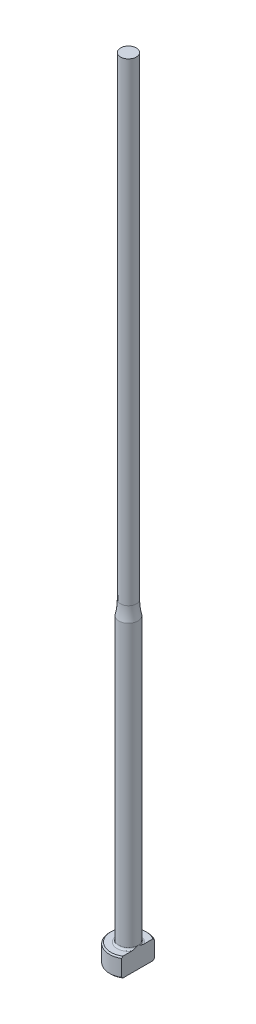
ISO-10303-21;
HEADER;
FILE_DESCRIPTION(('STEP AP214'),'2;1');
FILE_NAME('part.step','',(''),(''),'','','');
FILE_SCHEMA(('AUTOMOTIVE_DESIGN { 1 0 10303 214 1 1 1 1 }'));
ENDSEC;
DATA;
#1=APPLICATION_CONTEXT('core data for automotive mechanical design processes');
#2=APPLICATION_PROTOCOL_DEFINITION('international standard','automotive_design',2000,#1);
#3=PRODUCT_CONTEXT('',#1,'mechanical');
#4=PRODUCT('Part','Part','',(#3));
#5=PRODUCT_RELATED_PRODUCT_CATEGORY('part','',(#4));
#6=PRODUCT_DEFINITION_FORMATION('','',#4);
#7=PRODUCT_DEFINITION_CONTEXT('part definition',#1,'design');
#8=PRODUCT_DEFINITION('design','',#6,#7);
#9=PRODUCT_DEFINITION_SHAPE('','',#8);
#10=(LENGTH_UNIT() NAMED_UNIT(*) SI_UNIT(.MILLI.,.METRE.));
#11=(NAMED_UNIT(*) PLANE_ANGLE_UNIT() SI_UNIT($,.RADIAN.));
#12=(NAMED_UNIT(*) SI_UNIT($,.STERADIAN.) SOLID_ANGLE_UNIT());
#13=UNCERTAINTY_MEASURE_WITH_UNIT(LENGTH_MEASURE(1.E-05),#10,'distance_accuracy_value','');
#14=(GEOMETRIC_REPRESENTATION_CONTEXT(3) GLOBAL_UNCERTAINTY_ASSIGNED_CONTEXT((#13)) GLOBAL_UNIT_ASSIGNED_CONTEXT((#10,
#11,#12)) REPRESENTATION_CONTEXT('',''));
#15=CARTESIAN_POINT('',(0.,0.,0.));
#16=DIRECTION('',(0.,0.,1.));
#17=DIRECTION('',(1.,0.,0.));
#18=AXIS2_PLACEMENT_3D('',#15,#16,#17);
#19=CARTESIAN_POINT('',(-2.99999999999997,3.,0.));
#20=DIRECTION('',(0.,1.,0.));
#21=DIRECTION('',(0.,0.,1.));
#22=AXIS2_PLACEMENT_3D('',#19,#20,#21);
#23=PLANE('',#22);
#24=CARTESIAN_POINT('',(0.,3.,0.));
#25=DIRECTION('',(0.,1.,0.));
#26=DIRECTION('',(0.,0.,1.));
#27=AXIS2_PLACEMENT_3D('',#24,#25,#26);
#28=CIRCLE('',#27,2.79999999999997);
#29=CARTESIAN_POINT('',(1.49999999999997,3.,-2.36431808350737));
#30=VERTEX_POINT('',#29);
#31=CARTESIAN_POINT('',(1.49999999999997,3.,2.36431808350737));
#32=VERTEX_POINT('',#31);
#33=EDGE_CURVE('E187',#30,#32,#28,.T.);
#34=ORIENTED_EDGE('',*,*,#33,.T.);
#35=DIRECTION('',(0.,0.,-1.));
#36=VECTOR('',#35,1.);
#37=CARTESIAN_POINT('',(1.49999999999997,3.,0.));
#38=LINE('',#37,#36);
#39=CARTESIAN_POINT('',(1.49999999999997,3.00000000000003,0.99498743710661));
#40=VERTEX_POINT('',#39);
#41=EDGE_CURVE('E57',#32,#40,#38,.T.);
#42=ORIENTED_EDGE('',*,*,#41,.T.);
#43=CARTESIAN_POINT('',(0.,3.,0.));
#44=DIRECTION('',(0.,1.,0.));
#45=DIRECTION('',(0.,0.,1.));
#46=AXIS2_PLACEMENT_3D('',#43,#44,#45);
#47=CIRCLE('',#46,1.79999999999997);
#48=CARTESIAN_POINT('',(1.49999999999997,3.00000000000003,-0.994987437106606));
#49=VERTEX_POINT('',#48);
#50=EDGE_CURVE('E108',#40,#49,#47,.F.);
#51=ORIENTED_EDGE('',*,*,#50,.T.);
#52=EDGE_CURVE('E137',#49,#30,#38,.T.);
#53=ORIENTED_EDGE('',*,*,#52,.T.);
#54=EDGE_LOOP('',(#34,#42,#51,#53));
#55=FACE_BOUND('',#54,.T.);
#56=ADVANCED_FACE('F32',(#55),#23,.T.);
#57=CARTESIAN_POINT('',(0.,259.958771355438,0.));
#58=DIRECTION('',(0.,1.,0.));
#59=DIRECTION('',(0.,0.,1.));
#60=AXIS2_PLACEMENT_3D('',#57,#58,#59);
#61=CYLINDRICAL_SURFACE('',#60,2.99999999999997);
#62=CARTESIAN_POINT('',(0.,2.80000000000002,0.));
#63=DIRECTION('',(0.,1.,0.));
#64=DIRECTION('',(0.,0.,1.));
#65=AXIS2_PLACEMENT_3D('',#62,#63,#64);
#66=CIRCLE('',#65,2.99999999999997);
#67=CARTESIAN_POINT('',(1.49999999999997,2.80000000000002,2.5980762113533));
#68=VERTEX_POINT('',#67);
#69=CARTESIAN_POINT('',(1.49999999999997,2.80000000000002,-2.5980762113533));
#70=VERTEX_POINT('',#69);
#71=EDGE_CURVE('E105',#68,#70,#66,.F.);
#72=ORIENTED_EDGE('',*,*,#71,.T.);
#73=DIRECTION('',(0.,-1.,0.));
#74=VECTOR('',#73,1.);
#75=CARTESIAN_POINT('',(1.49999999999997,125.,-2.5980762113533));
#76=LINE('',#75,#74);
#77=CARTESIAN_POINT('',(1.49999999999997,0.200000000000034,-2.5980762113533));
#78=VERTEX_POINT('',#77);
#79=EDGE_CURVE('E193',#70,#78,#76,.T.);
#80=ORIENTED_EDGE('',*,*,#79,.T.);
#81=CARTESIAN_POINT('',(0.,0.200000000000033,0.));
#82=DIRECTION('',(0.,-1.,0.));
#83=DIRECTION('',(0.,0.,-1.));
#84=AXIS2_PLACEMENT_3D('',#81,#82,#83);
#85=CIRCLE('',#84,2.99999999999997);
#86=CARTESIAN_POINT('',(1.49999999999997,0.200000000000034,2.5980762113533));
#87=VERTEX_POINT('',#86);
#88=EDGE_CURVE('E100',#78,#87,#85,.F.);
#89=ORIENTED_EDGE('',*,*,#88,.T.);
#90=DIRECTION('',(0.,-1.,0.));
#91=VECTOR('',#90,1.);
#92=CARTESIAN_POINT('',(1.49999999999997,125.,2.5980762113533));
#93=LINE('',#92,#91);
#94=EDGE_CURVE('E93',#68,#87,#93,.T.);
#95=ORIENTED_EDGE('',*,*,#94,.F.);
#96=EDGE_LOOP('',(#72,#80,#89,#95));
#97=FACE_BOUND('',#96,.T.);
#98=ADVANCED_FACE('F158',(#97),#61,.T.);
#99=CARTESIAN_POINT('',(0.,0.,0.));
#100=DIRECTION('',(0.,-1.,0.));
#101=DIRECTION('',(0.,0.,-1.));
#102=AXIS2_PLACEMENT_3D('',#99,#100,#101);
#103=PLANE('',#102);
#104=CARTESIAN_POINT('',(0.,0.,0.));
#105=DIRECTION('',(0.,-1.,0.));
#106=DIRECTION('',(0.,0.,-1.));
#107=AXIS2_PLACEMENT_3D('',#104,#105,#106);
#108=CIRCLE('',#107,2.79999999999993);
#109=CARTESIAN_POINT('',(1.49999999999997,0.,2.36431808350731));
#110=VERTEX_POINT('',#109);
#111=CARTESIAN_POINT('',(1.49999999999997,0.,-2.36431808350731));
#112=VERTEX_POINT('',#111);
#113=EDGE_CURVE('E98',#110,#112,#108,.T.);
#114=ORIENTED_EDGE('',*,*,#113,.T.);
#115=DIRECTION('',(0.,0.,1.));
#116=VECTOR('',#115,1.);
#117=CARTESIAN_POINT('',(1.49999999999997,0.,-2.5980762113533));
#118=LINE('',#117,#116);
#119=EDGE_CURVE('E83',#112,#110,#118,.T.);
#120=ORIENTED_EDGE('',*,*,#119,.T.);
#121=EDGE_LOOP('',(#114,#120));
#122=FACE_BOUND('',#121,.T.);
#123=ADVANCED_FACE('F103',(#122),#103,.T.);
#124=CARTESIAN_POINT('',(0.,3.,0.));
#125=DIRECTION('',(0.,-1.,0.));
#126=DIRECTION('',(0.,0.,-1.));
#127=AXIS2_PLACEMENT_3D('',#124,#125,#126);
#128=CONICAL_SURFACE('',#127,2.79999999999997,0.7853981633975);
#129=ORIENTED_EDGE('',*,*,#71,.F.);
#130=CARTESIAN_POINT('',(1.49999999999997,-0.11174109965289,5.71827621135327));
#131=CARTESIAN_POINT('',(1.49999999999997,0.0136183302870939,5.58866816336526));
#132=CARTESIAN_POINT('',(1.49999999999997,0.138843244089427,5.45892957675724));
#133=CARTESIAN_POINT('',(1.49999999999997,0.388944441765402,5.19911365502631));
#134=CARTESIAN_POINT('',(1.49999999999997,0.513820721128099,5.06903631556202));
#135=CARTESIAN_POINT('',(1.49999999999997,0.763205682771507,4.8084018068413));
#136=CARTESIAN_POINT('',(1.49999999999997,0.887714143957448,4.67784442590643));
#137=CARTESIAN_POINT('',(1.49999999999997,1.13618059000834,4.41620813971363));
#138=CARTESIAN_POINT('',(1.49999999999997,1.2601385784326,4.28512923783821));
#139=CARTESIAN_POINT('',(1.49999999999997,1.50488975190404,4.02490837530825));
#140=CARTESIAN_POINT('',(1.49999999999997,1.6256969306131,3.89577958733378));
#141=CARTESIAN_POINT('',(1.49999999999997,1.86640694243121,3.63668213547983));
#142=CARTESIAN_POINT('',(1.49999999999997,1.98630978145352,3.5067134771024));
#143=CARTESIAN_POINT('',(1.49999999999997,2.22486033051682,3.24567921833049));
#144=CARTESIAN_POINT('',(1.49999999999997,2.34350830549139,3.11461386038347));
#145=CARTESIAN_POINT('',(1.49999999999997,2.57907716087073,2.85094268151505));
#146=CARTESIAN_POINT('',(1.49999999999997,2.69599811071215,2.71833692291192));
#147=CARTESIAN_POINT('',(1.49999999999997,2.88262371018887,2.50255231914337));
#148=CARTESIAN_POINT('',(1.49999999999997,2.95312454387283,2.42006293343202));
#149=CARTESIAN_POINT('',(1.49999999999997,3.09287098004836,2.25401084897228));
#150=CARTESIAN_POINT('',(1.49999999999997,3.16211645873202,2.170448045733));
#151=CARTESIAN_POINT('',(1.49999999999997,3.2996468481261,2.00105967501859));
#152=CARTESIAN_POINT('',(1.49999999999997,3.36791386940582,1.91521952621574));
#153=CARTESIAN_POINT('',(1.49999999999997,3.50205840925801,1.74171392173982));
#154=CARTESIAN_POINT('',(1.49999999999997,3.56793649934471,1.65404891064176));
#155=CARTESIAN_POINT('',(1.49999999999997,3.69728151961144,1.47490236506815));
#156=CARTESIAN_POINT('',(1.49999999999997,3.76069661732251,1.38338308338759));
#157=CARTESIAN_POINT('',(1.49999999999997,3.88239539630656,1.1967566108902));
#158=CARTESIAN_POINT('',(1.49999999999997,3.94067201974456,1.10164473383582));
#159=CARTESIAN_POINT('',(1.49999999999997,4.0484132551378,0.908008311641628));
#160=CARTESIAN_POINT('',(1.49999999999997,4.09797809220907,0.809540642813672));
#161=CARTESIAN_POINT('',(1.49999999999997,4.18432188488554,0.607192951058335));
#162=CARTESIAN_POINT('',(1.49999999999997,4.22114374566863,0.503332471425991));
#163=CARTESIAN_POINT('',(1.49999999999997,4.26099935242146,0.347577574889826));
#164=CARTESIAN_POINT('',(1.49999999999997,4.27157029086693,0.29760995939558));
#165=CARTESIAN_POINT('',(1.49999999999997,4.28794860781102,0.196885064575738));
#166=CARTESIAN_POINT('',(1.49999999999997,4.29375640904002,0.146127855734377));
#167=CARTESIAN_POINT('',(1.49999999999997,4.30019707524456,0.0444388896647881));
#168=CARTESIAN_POINT('',(1.49999999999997,4.30084594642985,-0.00649183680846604));
#169=CARTESIAN_POINT('',(1.49999999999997,4.29696416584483,-0.108155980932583));
#170=CARTESIAN_POINT('',(1.49999999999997,4.29243308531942,-0.158889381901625));
#171=CARTESIAN_POINT('',(1.49999999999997,4.27856915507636,-0.259234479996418));
#172=CARTESIAN_POINT('',(1.49999999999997,4.26927821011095,-0.308852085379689));
#173=CARTESIAN_POINT('',(1.49999999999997,4.24647108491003,-0.407110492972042));
#174=CARTESIAN_POINT('',(1.49999999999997,4.2329532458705,-0.455750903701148));
#175=CARTESIAN_POINT('',(1.49999999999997,4.20226175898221,-0.552149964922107));
#176=CARTESIAN_POINT('',(1.49999999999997,4.18506801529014,-0.599902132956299));
#177=CARTESIAN_POINT('',(1.49999999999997,4.14771387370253,-0.694205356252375));
#178=CARTESIAN_POINT('',(1.49999999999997,4.12755408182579,-0.740756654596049));
#179=CARTESIAN_POINT('',(1.49999999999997,4.06327696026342,-0.879166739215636));
#180=CARTESIAN_POINT('',(1.49999999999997,4.01551721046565,-0.969329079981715));
#181=CARTESIAN_POINT('',(1.49999999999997,3.91367909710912,-1.1460431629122));
#182=CARTESIAN_POINT('',(1.49999999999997,3.85959300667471,-1.23259031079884));
#183=CARTESIAN_POINT('',(1.49999999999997,3.74697968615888,-1.40321348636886));
#184=CARTESIAN_POINT('',(1.49999999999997,3.68843573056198,-1.48727838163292));
#185=CARTESIAN_POINT('',(1.49999999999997,3.56843845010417,-1.65322187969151));
#186=CARTESIAN_POINT('',(1.49999999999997,3.50698656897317,-1.73510153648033));
#187=CARTESIAN_POINT('',(1.49999999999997,3.38115673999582,-1.89829823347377));
#188=CARTESIAN_POINT('',(1.49999999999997,3.31675092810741,-1.9795936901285));
#189=CARTESIAN_POINT('',(1.49999999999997,3.18634068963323,-2.14090082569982));
#190=CARTESIAN_POINT('',(1.49999999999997,3.12033609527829,-2.22091236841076));
#191=CARTESIAN_POINT('',(1.49999999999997,2.9208643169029,-2.4590650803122));
#192=CARTESIAN_POINT('',(1.49999999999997,2.78562663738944,-2.6157209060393));
#193=CARTESIAN_POINT('',(1.49999999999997,2.53554498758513,-2.90006295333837));
#194=CARTESIAN_POINT('',(1.49999999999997,2.421145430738,-3.02814382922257));
#195=CARTESIAN_POINT('',(1.49999999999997,2.19093557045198,-3.28303767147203));
#196=CARTESIAN_POINT('',(1.49999999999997,2.07512522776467,-3.40985060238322));
#197=CARTESIAN_POINT('',(1.49999999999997,1.72597067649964,-3.78913849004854));
#198=CARTESIAN_POINT('',(1.49999999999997,1.49111760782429,-4.04022177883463));
#199=CARTESIAN_POINT('',(1.49999999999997,1.02882478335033,-4.52992803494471));
#200=CARTESIAN_POINT('',(1.49999999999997,0.801477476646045,-4.76863870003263));
#201=CARTESIAN_POINT('',(1.49999999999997,0.459548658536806,-5.12558036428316));
#202=CARTESIAN_POINT('',(1.49999999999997,0.345484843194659,-5.24430773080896));
#203=CARTESIAN_POINT('',(1.49999999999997,0.117071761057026,-5.48148573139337));
#204=CARTESIAN_POINT('',(1.49999999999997,0.00272249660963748,-5.59993636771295));
#205=CARTESIAN_POINT('',(1.49999999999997,-0.111741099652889,-5.71827621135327));
#206=B_SPLINE_CURVE_WITH_KNOTS('',3,(#130,#131,#132,#133,#134,#135,#136,#137,#138,#139,#140,
#141,#142,#143,#144,#145,#146,#147,#148,#149,#150,#151,#152,#153,#154,#155,#156,#157,#158,#159,
#160,#161,#162,#163,#164,#165,#166,#167,#168,#169,#170,#171,#172,#173,#174,#175,#176,#177,#178,
#179,#180,#181,#182,#183,#184,#185,#186,#187,#188,#189,#190,#191,#192,#193,#194,#195,#196,#197,
#198,#199,#200,#201,#202,#203,#204,#205),.UNSPECIFIED.,.F.,.F.,(4,2,2,2,2,2,2,2,2,2,2,2,2,2,2,2,
2,2,2,2,2,2,2,2,2,2,2,2,2,2,2,2,2,2,2,2,2,4),(0.,0.540943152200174,1.08189327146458,
1.62312052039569,2.16434426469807,2.69482920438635,3.22531067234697,3.75567781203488,
4.28602356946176,4.61155053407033,4.93710943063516,5.26610945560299,5.59503024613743,
5.92894782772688,6.26331713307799,6.59354403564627,6.92264800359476,7.07567478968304,
7.22868799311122,7.38122626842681,7.53377717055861,7.68500755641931,7.83629736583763,
7.98843643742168,8.14054446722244,8.4461879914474,8.75220879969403,9.05944044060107,
9.366521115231,9.677642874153,9.98879742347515,10.6095925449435,11.1247803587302,
11.6399825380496,12.6713544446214,13.6603005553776,14.1542238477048,14.648143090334),.UNSPECIFIED.);
#207=EDGE_CURVE('E136',#68,#32,#206,.T.);
#208=ORIENTED_EDGE('',*,*,#207,.T.);
#209=ORIENTED_EDGE('',*,*,#33,.F.);
#210=EDGE_CURVE('E128',#30,#70,#206,.T.);
#211=ORIENTED_EDGE('',*,*,#210,.T.);
#212=EDGE_LOOP('',(#129,#208,#209,#211));
#213=FACE_BOUND('',#212,.T.);
#214=ADVANCED_FACE('F144',(#213),#128,.T.);
#215=CARTESIAN_POINT('',(0.,0.200000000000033,0.));
#216=DIRECTION('',(0.,1.,0.));
#217=DIRECTION('',(0.,0.,1.));
#218=AXIS2_PLACEMENT_3D('',#215,#216,#217);
#219=CONICAL_SURFACE('',#218,2.99999999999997,0.785398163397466);
#220=ORIENTED_EDGE('',*,*,#88,.F.);
#221=CARTESIAN_POINT('',(1.49999999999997,3.11174109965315,-5.71827621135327));
#222=CARTESIAN_POINT('',(1.49999999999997,2.98638166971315,-5.58866816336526));
#223=CARTESIAN_POINT('',(1.49999999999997,2.8611567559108,-5.45892957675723));
#224=CARTESIAN_POINT('',(1.49999999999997,2.6110555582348,-5.19911365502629));
#225=CARTESIAN_POINT('',(1.49999999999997,2.48617927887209,-5.06903631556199));
#226=CARTESIAN_POINT('',(1.49999999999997,2.23679431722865,-4.80840180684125));
#227=CARTESIAN_POINT('',(1.49999999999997,2.11228585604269,-4.67784442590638));
#228=CARTESIAN_POINT('',(1.49999999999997,1.86381940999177,-4.41620813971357));
#229=CARTESIAN_POINT('',(1.49999999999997,1.7398614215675,-4.28512923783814));
#230=CARTESIAN_POINT('',(1.49999999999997,1.49511024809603,-4.02490837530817));
#231=CARTESIAN_POINT('',(1.49999999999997,1.37430306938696,-3.89577958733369));
#232=CARTESIAN_POINT('',(1.49999999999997,1.13359305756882,-3.63668213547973));
#233=CARTESIAN_POINT('',(1.49999999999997,1.0136902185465,-3.50671347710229));
#234=CARTESIAN_POINT('',(1.49999999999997,0.775139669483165,-3.24567921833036));
#235=CARTESIAN_POINT('',(1.49999999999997,0.656491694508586,-3.11461386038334));
#236=CARTESIAN_POINT('',(1.49999999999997,0.420922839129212,-2.85094268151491));
#237=CARTESIAN_POINT('',(1.49999999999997,0.304001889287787,-2.71833692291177));
#238=CARTESIAN_POINT('',(1.49999999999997,0.117376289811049,-2.50255231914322));
#239=CARTESIAN_POINT('',(1.49999999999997,0.0468754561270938,-2.42006293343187));
#240=CARTESIAN_POINT('',(1.49999999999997,-0.0928709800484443,-2.25401084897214));
#241=CARTESIAN_POINT('',(1.49999999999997,-0.162116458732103,-2.17044804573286));
#242=CARTESIAN_POINT('',(1.49999999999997,-0.299646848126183,-2.00105967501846));
#243=CARTESIAN_POINT('',(1.49999999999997,-0.367913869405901,-1.91521952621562));
#244=CARTESIAN_POINT('',(1.49999999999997,-0.502058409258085,-1.74171392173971));
#245=CARTESIAN_POINT('',(1.49999999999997,-0.567936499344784,-1.65404891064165));
#246=CARTESIAN_POINT('',(1.49999999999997,-0.697281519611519,-1.47490236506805));
#247=CARTESIAN_POINT('',(1.49999999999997,-0.760696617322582,-1.38338308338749));
#248=CARTESIAN_POINT('',(1.49999999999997,-0.882395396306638,-1.19675661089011));
#249=CARTESIAN_POINT('',(1.49999999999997,-0.940672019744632,-1.10164473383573));
#250=CARTESIAN_POINT('',(1.49999999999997,-1.04841325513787,-0.908008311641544));
#251=CARTESIAN_POINT('',(1.49999999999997,-1.09797809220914,-0.809540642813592));
#252=CARTESIAN_POINT('',(1.49999999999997,-1.1843218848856,-0.60719295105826));
#253=CARTESIAN_POINT('',(1.49999999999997,-1.22114374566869,-0.503332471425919));
#254=CARTESIAN_POINT('',(1.49999999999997,-1.26099935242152,-0.347577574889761));
#255=CARTESIAN_POINT('',(1.49999999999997,-1.27157029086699,-0.29760995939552));
#256=CARTESIAN_POINT('',(1.49999999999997,-1.28794860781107,-0.196885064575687));
#257=CARTESIAN_POINT('',(1.49999999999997,-1.29375640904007,-0.146127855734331));
#258=CARTESIAN_POINT('',(1.49999999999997,-1.30019707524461,-0.0444388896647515));
#259=CARTESIAN_POINT('',(1.49999999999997,-1.3008459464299,0.00649183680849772));
#260=CARTESIAN_POINT('',(1.49999999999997,-1.29696416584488,0.108155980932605));
#261=CARTESIAN_POINT('',(1.49999999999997,-1.29243308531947,0.158889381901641));
#262=CARTESIAN_POINT('',(1.49999999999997,-1.2785691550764,0.259234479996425));
#263=CARTESIAN_POINT('',(1.49999999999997,-1.26927821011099,0.308852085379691));
#264=CARTESIAN_POINT('',(1.49999999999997,-1.24647108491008,0.407110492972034));
#265=CARTESIAN_POINT('',(1.49999999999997,-1.23295324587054,0.455750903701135));
#266=CARTESIAN_POINT('',(1.49999999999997,-1.20226175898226,0.552149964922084));
#267=CARTESIAN_POINT('',(1.49999999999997,-1.18506801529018,0.599902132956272));
#268=CARTESIAN_POINT('',(1.49999999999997,-1.14771387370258,0.694205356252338));
#269=CARTESIAN_POINT('',(1.49999999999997,-1.12755408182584,0.740756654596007));
#270=CARTESIAN_POINT('',(1.49999999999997,-1.06327696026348,0.879166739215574));
#271=CARTESIAN_POINT('',(1.49999999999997,-1.01551721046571,0.969329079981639));
#272=CARTESIAN_POINT('',(1.49999999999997,-0.913679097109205,1.1460431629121));
#273=CARTESIAN_POINT('',(1.49999999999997,-0.8595930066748,1.23259031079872));
#274=CARTESIAN_POINT('',(1.49999999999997,-0.746979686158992,1.40321348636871));
#275=CARTESIAN_POINT('',(1.49999999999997,-0.688435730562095,1.48727838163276));
#276=CARTESIAN_POINT('',(1.49999999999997,-0.568438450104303,1.65322187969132));
#277=CARTESIAN_POINT('',(1.49999999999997,-0.506986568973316,1.73510153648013));
#278=CARTESIAN_POINT('',(1.49999999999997,-0.381156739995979,1.89829823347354));
#279=CARTESIAN_POINT('',(1.49999999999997,-0.316750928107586,1.97959369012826));
#280=CARTESIAN_POINT('',(1.49999999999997,-0.186340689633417,2.14090082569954));
#281=CARTESIAN_POINT('',(1.49999999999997,-0.120336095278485,2.22091236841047));
#282=CARTESIAN_POINT('',(1.49999999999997,0.0791356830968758,2.45906508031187));
#283=CARTESIAN_POINT('',(1.49999999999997,0.214373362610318,2.61572090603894));
#284=CARTESIAN_POINT('',(1.49999999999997,0.46445501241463,2.90006295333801));
#285=CARTESIAN_POINT('',(1.49999999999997,0.578854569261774,3.02814382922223));
#286=CARTESIAN_POINT('',(1.49999999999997,0.809064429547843,3.28303767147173));
#287=CARTESIAN_POINT('',(1.49999999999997,0.924874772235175,3.40985060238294));
#288=CARTESIAN_POINT('',(1.49999999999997,1.27402932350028,3.78913849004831));
#289=CARTESIAN_POINT('',(1.49999999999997,1.50888239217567,4.04022177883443));
#290=CARTESIAN_POINT('',(1.49999999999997,1.97117521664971,4.52992803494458));
#291=CARTESIAN_POINT('',(1.49999999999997,2.19852252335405,4.76863870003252));
#292=CARTESIAN_POINT('',(1.49999999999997,2.54045134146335,5.12558036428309));
#293=CARTESIAN_POINT('',(1.49999999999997,2.65451515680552,5.2443077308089));
#294=CARTESIAN_POINT('',(1.49999999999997,2.88292823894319,5.48148573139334));
#295=CARTESIAN_POINT('',(1.49999999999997,2.9972775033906,5.59993636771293));
#296=CARTESIAN_POINT('',(1.49999999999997,3.11174109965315,5.71827621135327));
#297=B_SPLINE_CURVE_WITH_KNOTS('',3,(#221,#222,#223,#224,#225,#226,#227,#228,#229,#230,#231,
#232,#233,#234,#235,#236,#237,#238,#239,#240,#241,#242,#243,#244,#245,#246,#247,#248,#249,#250,
#251,#252,#253,#254,#255,#256,#257,#258,#259,#260,#261,#262,#263,#264,#265,#266,#267,#268,#269,
#270,#271,#272,#273,#274,#275,#276,#277,#278,#279,#280,#281,#282,#283,#284,#285,#286,#287,#288,
#289,#290,#291,#292,#293,#294,#295,#296),.UNSPECIFIED.,.F.,.F.,(4,2,2,2,2,2,2,2,2,2,2,2,2,2,2,2,
2,2,2,2,2,2,2,2,2,2,2,2,2,2,2,2,2,2,2,2,2,4),(0.,0.540943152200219,1.08189327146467,
1.62312052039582,2.16434426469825,2.69482920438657,3.22531067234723,3.75567781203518,
4.28602356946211,4.61155053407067,4.93710943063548,5.2661094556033,5.59503024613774,
5.92894782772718,6.26331713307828,6.59354403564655,6.92264800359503,7.0756747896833,
7.22868799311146,7.38122626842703,7.53377717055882,7.68500755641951,7.83629736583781,
7.98843643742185,8.14054446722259,8.4461879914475,8.75220879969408,9.05944044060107,
9.36652111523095,9.6776428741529,9.98879742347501,10.6095925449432,11.1247803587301,
11.6399825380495,12.6713544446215,13.6603005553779,14.1542238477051,14.6481430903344),.UNSPECIFIED.);
#298=EDGE_CURVE('E86',#78,#112,#297,.T.);
#299=ORIENTED_EDGE('',*,*,#298,.T.);
#300=ORIENTED_EDGE('',*,*,#113,.F.);
#301=EDGE_CURVE('E89',#110,#87,#297,.T.);
#302=ORIENTED_EDGE('',*,*,#301,.T.);
#303=EDGE_LOOP('',(#220,#299,#300,#302));
#304=FACE_BOUND('',#303,.T.);
#305=ADVANCED_FACE('F97',(#304),#219,.T.);
#306=CARTESIAN_POINT('',(0.,3.30000000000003,0.));
#307=DIRECTION('',(0.,1.,0.));
#308=DIRECTION('',(0.,0.,1.));
#309=AXIS2_PLACEMENT_3D('',#306,#307,#308);
#310=TOROIDAL_SURFACE('',#309,1.79999999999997,0.3);
#311=CARTESIAN_POINT('',(1.49999999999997,3.30000000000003,0.));
#312=CARTESIAN_POINT('',(1.49999999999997,3.300000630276,3.41555678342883E-12));
#313=CARTESIAN_POINT('',(1.49999999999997,3.30000126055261,-1.15373640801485E-07));
#314=CARTESIAN_POINT('',(1.49999999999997,3.3000024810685,-4.90631575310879E-07));
#315=CARTESIAN_POINT('',(1.49999999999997,3.30000307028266,-7.53296670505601E-07));
#316=CARTESIAN_POINT('',(1.49999999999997,3.30000424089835,-1.38757096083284E-06));
#317=CARTESIAN_POINT('',(1.49999999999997,3.300004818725,-1.76563001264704E-06));
#318=CARTESIAN_POINT('',(1.49999999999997,3.30000591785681,-2.58768006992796E-06));
#319=CARTESIAN_POINT('',(1.49999999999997,3.30000643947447,-3.03127014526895E-06));
#320=CARTESIAN_POINT('',(1.49999999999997,3.30000815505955,-4.60021967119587E-06));
#321=CARTESIAN_POINT('',(1.49999999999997,3.30000927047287,-5.8124152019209E-06));
#322=CARTESIAN_POINT('',(1.49999999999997,3.30001128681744,-8.33989413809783E-06));
#323=CARTESIAN_POINT('',(1.49999999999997,3.30001219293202,-9.65128157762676E-06));
#324=CARTESIAN_POINT('',(1.49999999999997,3.30001551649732,-1.46782505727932E-05));
#325=CARTESIAN_POINT('',(1.49999999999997,3.30001775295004,-1.8517976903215E-05));
#326=CARTESIAN_POINT('',(1.49999999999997,3.30002148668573,-2.61616194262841E-05));
#327=CARTESIAN_POINT('',(1.49999999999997,3.30002302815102,-2.99447742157E-05));
#328=CARTESIAN_POINT('',(1.49999999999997,3.30002943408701,-4.58003743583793E-05));
#329=CARTESIAN_POINT('',(1.49999999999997,3.3000341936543,-5.79079078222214E-05));
#330=CARTESIAN_POINT('',(1.49999999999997,3.30004197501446,-8.07263755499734E-05));
#331=CARTESIAN_POINT('',(1.49999999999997,3.30004514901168,-9.13834709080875E-05));
#332=CARTESIAN_POINT('',(1.49999999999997,3.30006989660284,-0.000167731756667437));
#333=CARTESIAN_POINT('',(1.49999999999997,3.30010092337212,-0.000229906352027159));
#334=CARTESIAN_POINT('',(1.49999999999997,3.30021632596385,-0.000470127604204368));
#335=CARTESIAN_POINT('',(1.49999999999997,3.30029368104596,-0.000650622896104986));
#336=CARTESIAN_POINT('',(1.49999999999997,3.30059619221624,-0.00134589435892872));
#337=CARTESIAN_POINT('',(1.49999999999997,3.30082870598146,-0.00185814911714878));
#338=CARTESIAN_POINT('',(1.49999999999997,3.30176696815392,-0.00393547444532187));
#339=CARTESIAN_POINT('',(1.49999999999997,3.30246445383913,-0.00550332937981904));
#340=CARTESIAN_POINT('',(1.49999999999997,3.31426785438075,-0.0320229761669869));
#341=CARTESIAN_POINT('',(1.49999999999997,3.32544800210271,-0.0569503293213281));
#342=CARTESIAN_POINT('',(1.49999999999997,3.34725700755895,-0.105984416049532));
#343=CARTESIAN_POINT('',(1.49999999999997,3.35789134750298,-0.130088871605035));
#344=CARTESIAN_POINT('',(1.49999999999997,3.38015321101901,-0.181096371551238));
#345=CARTESIAN_POINT('',(1.49999999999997,3.39175804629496,-0.208009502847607));
#346=CARTESIAN_POINT('',(1.49999999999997,3.41469034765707,-0.262264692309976));
#347=CARTESIAN_POINT('',(1.49999999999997,3.42601398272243,-0.289608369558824));
#348=CARTESIAN_POINT('',(1.49999999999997,3.45363212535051,-0.35820378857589));
#349=CARTESIAN_POINT('',(1.49999999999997,3.46959026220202,-0.39959288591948));
#350=CARTESIAN_POINT('',(1.49999999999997,3.49940505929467,-0.482097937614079));
#351=CARTESIAN_POINT('',(1.49999999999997,3.51330033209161,-0.523199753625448));
#352=CARTESIAN_POINT('',(1.49999999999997,3.53552507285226,-0.595497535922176));
#353=CARTESIAN_POINT('',(1.49999999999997,3.54436834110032,-0.626532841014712));
#354=CARTESIAN_POINT('',(1.49999999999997,3.56052427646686,-0.6891760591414));
#355=CARTESIAN_POINT('',(1.49999999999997,3.5678279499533,-0.720786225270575));
#356=CARTESIAN_POINT('',(1.49999999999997,3.5875075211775,-0.819524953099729));
#357=CARTESIAN_POINT('',(1.49999999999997,3.59661044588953,-0.88742909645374));
#358=CARTESIAN_POINT('',(1.49999999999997,3.60059842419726,-0.991180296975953));
#359=CARTESIAN_POINT('',(1.49999999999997,3.60019840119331,-1.02684364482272));
#360=CARTESIAN_POINT('',(1.49999999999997,3.59497085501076,-1.097505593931));
#361=CARTESIAN_POINT('',(1.49999999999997,3.59019295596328,-1.13250716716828));
#362=CARTESIAN_POINT('',(1.49999999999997,3.57687734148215,-1.19353096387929));
#363=CARTESIAN_POINT('',(1.49999999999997,3.56943875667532,-1.21978854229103));
#364=CARTESIAN_POINT('',(1.49999999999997,3.55063748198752,-1.27094658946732));
#365=CARTESIAN_POINT('',(1.49999999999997,3.53927342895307,-1.29584658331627));
#366=CARTESIAN_POINT('',(1.49999999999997,3.51660016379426,-1.33501873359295));
#367=CARTESIAN_POINT('',(1.49999999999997,3.50657738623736,-1.35003296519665));
#368=CARTESIAN_POINT('',(1.49999999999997,3.48437469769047,-1.37837252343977));
#369=CARTESIAN_POINT('',(1.49999999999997,3.47219867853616,-1.39170082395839));
#370=CARTESIAN_POINT('',(1.49999999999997,3.44835614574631,-1.41349417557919));
#371=CARTESIAN_POINT('',(1.49999999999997,3.43709185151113,-1.42239673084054));
#372=CARTESIAN_POINT('',(1.49999999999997,3.41325256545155,-1.43825467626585));
#373=CARTESIAN_POINT('',(1.49999999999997,3.40067804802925,-1.44521076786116));
#374=CARTESIAN_POINT('',(1.49999999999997,3.37433767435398,-1.45677158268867));
#375=CARTESIAN_POINT('',(1.49999999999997,3.36056203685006,-1.46135438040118));
#376=CARTESIAN_POINT('',(1.49999999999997,3.33237324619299,-1.46767730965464));
#377=CARTESIAN_POINT('',(1.49999999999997,3.31796076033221,-1.46942034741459));
#378=CARTESIAN_POINT('',(1.49999999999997,3.29122479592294,-1.4698720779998));
#379=CARTESIAN_POINT('',(1.49999999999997,3.27890664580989,-1.468990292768));
#380=CARTESIAN_POINT('',(1.49999999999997,3.25461019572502,-1.4651157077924));
#381=CARTESIAN_POINT('',(1.49999999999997,3.2426318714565,-1.46212305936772));
#382=CARTESIAN_POINT('',(1.49999999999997,3.21959683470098,-1.4543117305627));
#383=CARTESIAN_POINT('',(1.49999999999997,3.20852542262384,-1.44953579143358));
#384=CARTESIAN_POINT('',(1.49999999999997,3.18721125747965,-1.43840957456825));
#385=CARTESIAN_POINT('',(1.49999999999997,3.1769687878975,-1.43205876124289));
#386=CARTESIAN_POINT('',(1.49999999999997,3.15325976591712,-1.41506353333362));
#387=CARTESIAN_POINT('',(1.49999999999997,3.14027750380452,-1.40374235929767));
#388=CARTESIAN_POINT('',(1.49999999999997,3.11630720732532,-1.37914825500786));
#389=CARTESIAN_POINT('',(1.49999999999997,3.10532420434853,-1.36587054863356));
#390=CARTESIAN_POINT('',(1.49999999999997,3.08100891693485,-1.33197272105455));
#391=CARTESIAN_POINT('',(1.49999999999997,3.06867625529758,-1.31063843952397));
#392=CARTESIAN_POINT('',(1.49999999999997,3.04751867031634,-1.26637455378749));
#393=CARTESIAN_POINT('',(1.49999999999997,3.03869240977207,-1.24344556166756));
#394=CARTESIAN_POINT('',(1.49999999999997,3.01978360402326,-1.18316534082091));
#395=CARTESIAN_POINT('',(1.49999999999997,3.01191472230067,-1.14512623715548));
#396=CARTESIAN_POINT('',(1.49999999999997,3.00188285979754,-1.06789971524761));
#397=CARTESIAN_POINT('',(1.49999999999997,2.99979735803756,-1.02870374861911));
#398=CARTESIAN_POINT('',(1.49999999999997,3.00021727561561,-0.953160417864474));
#399=CARTESIAN_POINT('',(1.49999999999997,3.00240673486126,-0.916808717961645));
#400=CARTESIAN_POINT('',(1.49999999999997,3.0099643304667,-0.844432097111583));
#401=CARTESIAN_POINT('',(1.49999999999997,3.01533462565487,-0.808407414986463));
#402=CARTESIAN_POINT('',(1.49999999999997,3.02828086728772,-0.738670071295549));
#403=CARTESIAN_POINT('',(1.49999999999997,3.03573028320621,-0.704933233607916));
#404=CARTESIAN_POINT('',(1.49999999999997,3.05243174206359,-0.638128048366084));
#405=CARTESIAN_POINT('',(1.49999999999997,3.06167285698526,-0.605056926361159));
#406=CARTESIAN_POINT('',(1.49999999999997,3.08440652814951,-0.53019513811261));
#407=CARTESIAN_POINT('',(1.49999999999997,3.09836576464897,-0.488547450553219));
#408=CARTESIAN_POINT('',(1.49999999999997,3.1283820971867,-0.404954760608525));
#409=CARTESIAN_POINT('',(1.49999999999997,3.14447968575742,-0.363024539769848));
#410=CARTESIAN_POINT('',(1.49999999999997,3.17238454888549,-0.293508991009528));
#411=CARTESIAN_POINT('',(1.49999999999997,3.18384249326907,-0.265781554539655));
#412=CARTESIAN_POINT('',(1.49999999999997,3.20705854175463,-0.210769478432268));
#413=CARTESIAN_POINT('',(1.49999999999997,3.21881265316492,-0.183483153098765));
#414=CARTESIAN_POINT('',(1.49999999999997,3.24136702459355,-0.131772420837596));
#415=CARTESIAN_POINT('',(1.49999999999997,3.25214361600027,-0.107337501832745));
#416=CARTESIAN_POINT('',(1.49999999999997,3.27424746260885,-0.0576321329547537));
#417=CARTESIAN_POINT('',(1.49999999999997,3.28558038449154,-0.0323640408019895));
#418=CARTESIAN_POINT('',(1.49999999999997,3.29753556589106,-0.00550327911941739));
#419=CARTESIAN_POINT('',(1.49999999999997,3.29823307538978,-0.00393537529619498));
#420=CARTESIAN_POINT('',(1.49999999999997,3.29917134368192,-0.00185803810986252));
#421=CARTESIAN_POINT('',(1.49999999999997,3.29940384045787,-0.00134582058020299));
#422=CARTESIAN_POINT('',(1.49999999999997,3.29970633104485,-0.000650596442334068));
#423=CARTESIAN_POINT('',(1.49999999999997,3.29978368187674,-0.000470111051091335));
#424=CARTESIAN_POINT('',(1.49999999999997,3.29989907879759,-0.000229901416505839));
#425=CARTESIAN_POINT('',(1.49999999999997,3.29993010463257,-0.000167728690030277));
#426=CARTESIAN_POINT('',(1.49999999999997,3.29995485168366,-9.13825689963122E-05));
#427=CARTESIAN_POINT('',(1.49999999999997,3.29995802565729,-8.07256241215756E-05));
#428=CARTESIAN_POINT('',(1.49999999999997,3.29996580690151,-5.79074820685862E-05));
#429=CARTESIAN_POINT('',(1.49999999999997,3.29997056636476,-4.5800119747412E-05));
#430=CARTESIAN_POINT('',(1.49999999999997,3.29997697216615,-2.99447119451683E-05));
#431=CARTESIAN_POINT('',(1.49999999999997,3.2999785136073,-2.61615817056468E-05));
#432=CARTESIAN_POINT('',(1.49999999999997,3.2999822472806,-1.85179845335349E-05));
#433=CARTESIAN_POINT('',(1.49999999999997,3.29998448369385,-1.46782782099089E-05));
#434=CARTESIAN_POINT('',(1.49999999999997,3.2999878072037,-9.65132752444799E-06));
#435=CARTESIAN_POINT('',(1.49999999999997,3.299988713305,-8.33994202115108E-06));
#436=CARTESIAN_POINT('',(1.49999999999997,3.29999072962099,-5.81246426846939E-06));
#437=CARTESIAN_POINT('',(1.49999999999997,3.29999184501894,-4.600267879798E-06));
#438=CARTESIAN_POINT('',(1.49999999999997,3.29999356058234,-3.03131394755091E-06));
#439=CARTESIAN_POINT('',(1.49999999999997,3.29999408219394,-2.58772196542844E-06));
#440=CARTESIAN_POINT('',(1.49999999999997,3.2999951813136,-1.76566701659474E-06));
#441=CARTESIAN_POINT('',(1.49999999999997,3.29999575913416,-1.38760497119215E-06));
#442=CARTESIAN_POINT('',(1.49999999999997,3.29999692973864,-7.53323425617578E-07));
#443=CARTESIAN_POINT('',(1.49999999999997,3.29999751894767,-4.90654189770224E-07));
#444=CARTESIAN_POINT('',(1.49999999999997,3.29999873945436,-1.15386267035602E-07));
#445=CARTESIAN_POINT('',(1.49999999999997,3.29999936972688,-3.41554144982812E-12));
#446=CARTESIAN_POINT('',(1.49999999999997,3.30000000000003,0.));
#447=B_SPLINE_CURVE_WITH_KNOTS('',3,(#311,#312,#313,#314,#315,#316,#317,#318,#319,#320,#321,
#322,#323,#324,#325,#326,#327,#328,#329,#330,#331,#332,#333,#334,#335,#336,#337,#338,#339,#340,
#341,#342,#343,#344,#345,#346,#347,#348,#349,#350,#351,#352,#353,#354,#355,#356,#357,#358,#359,
#360,#361,#362,#363,#364,#365,#366,#367,#368,#369,#370,#371,#372,#373,#374,#375,#376,#377,#378,
#379,#380,#381,#382,#383,#384,#385,#386,#387,#388,#389,#390,#391,#392,#393,#394,#395,#396,#397,
#398,#399,#400,#401,#402,#403,#404,#405,#406,#407,#408,#409,#410,#411,#412,#413,#414,#415,#416,
#417,#418,#419,#420,#421,#422,#423,#424,#425,#426,#427,#428,#429,#430,#431,#432,#433,#434,#435,
#436,#437,#438,#439,#440,#441,#442,#443,#444,#445,#446),.UNSPECIFIED.,.T.,.F.,(4,2,2,2,2,2,2,2,
2,2,2,2,2,2,2,2,2,2,2,2,2,2,2,2,2,2,2,2,2,2,2,2,2,2,2,2,2,2,2,2,2,2,2,2,2,2,2,2,2,2,2,2,2,2,2,2,
2,2,2,2,2,2,2,2,2,2,2,4),(0.,1.88906036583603E-06,3.8150959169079E-06,5.87892837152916E-06,
7.93062024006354E-06,1.28480890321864E-05,1.76261717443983E-05,3.0909918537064E-05,
4.31529750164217E-05,8.21699329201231E-05,0.000115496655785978,0.000323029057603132,
0.000912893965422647,0.00259963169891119,0.00774858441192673,0.0896975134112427,
0.168737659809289,0.256660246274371,0.345444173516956,0.478492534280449,0.608603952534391,
0.705372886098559,0.802692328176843,1.00719557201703,1.11399616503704,1.21960092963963,
1.30124317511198,1.38291380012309,1.43690814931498,1.49080588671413,1.53371524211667,
1.57660911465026,1.61989249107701,1.66313154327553,1.69999492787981,1.73685567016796,
1.77288440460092,1.80892540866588,1.86031324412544,1.91182866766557,1.98534297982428,
2.05882922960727,2.1747172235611,2.29215041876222,2.40123170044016,2.51038710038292,
2.613972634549,2.71694519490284,2.84866234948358,2.98337525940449,3.07337666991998,
3.16250453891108,3.24262397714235,3.32569301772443,3.3308421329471,3.33252874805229,
3.33311858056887,3.33332610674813,3.33335943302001,3.33339844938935,3.3334106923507,
3.33342397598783,3.33342875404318,3.33343367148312,3.33343572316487,3.33343778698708,
3.33343971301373,3.33344160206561),.UNSPECIFIED.);
#448=CARTESIAN_POINT('',(1.49999999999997,3.30000000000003,0.));
#449=VERTEX_POINT('',#448);
#450=EDGE_CURVE('E11',#49,#449,#447,.T.);
#451=ORIENTED_EDGE('',*,*,#450,.F.);
#452=ORIENTED_EDGE('',*,*,#50,.F.);
#453=CARTESIAN_POINT('',(1.49999999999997,3.30000000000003,0.));
#454=CARTESIAN_POINT('',(1.49999999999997,3.29999936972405,-3.41547770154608E-12));
#455=CARTESIAN_POINT('',(1.49999999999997,3.29999873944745,1.15373640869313E-07));
#456=CARTESIAN_POINT('',(1.49999999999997,3.29999751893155,4.90631575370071E-07));
#457=CARTESIAN_POINT('',(1.49999999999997,3.29999692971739,7.53296670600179E-07));
#458=CARTESIAN_POINT('',(1.49999999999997,3.2999957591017,1.38757096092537E-06));
#459=CARTESIAN_POINT('',(1.49999999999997,3.29999518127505,1.76563001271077E-06));
#460=CARTESIAN_POINT('',(1.49999999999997,3.29999408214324,2.58768007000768E-06));
#461=CARTESIAN_POINT('',(1.49999999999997,3.29999356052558,3.03127014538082E-06));
#462=CARTESIAN_POINT('',(1.49999999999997,3.2999918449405,4.60021967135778E-06));
#463=CARTESIAN_POINT('',(1.49999999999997,3.29999072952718,5.81241520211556E-06));
#464=CARTESIAN_POINT('',(1.49999999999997,3.29998871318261,8.33989413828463E-06));
#465=CARTESIAN_POINT('',(1.49999999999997,3.29998780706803,9.65128157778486E-06));
#466=CARTESIAN_POINT('',(1.49999999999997,3.29998448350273,1.46782505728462E-05));
#467=CARTESIAN_POINT('',(1.49999999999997,3.29998224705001,1.85179769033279E-05));
#468=CARTESIAN_POINT('',(1.49999999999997,3.29997851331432,2.61616194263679E-05));
#469=CARTESIAN_POINT('',(1.49999999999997,3.29997697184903,2.99447742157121E-05));
#470=CARTESIAN_POINT('',(1.49999999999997,3.29997056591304,4.58003743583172E-05));
#471=CARTESIAN_POINT('',(1.49999999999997,3.29996580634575,5.79079078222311E-05));
#472=CARTESIAN_POINT('',(1.49999999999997,3.29995802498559,8.07263755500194E-05));
#473=CARTESIAN_POINT('',(1.49999999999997,3.29995485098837,9.1383470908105E-05));
#474=CARTESIAN_POINT('',(1.49999999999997,3.29993010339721,0.000167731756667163));
#475=CARTESIAN_POINT('',(1.49999999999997,3.29989907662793,0.000229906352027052));
#476=CARTESIAN_POINT('',(1.49999999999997,3.2997836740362,0.000470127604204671));
#477=CARTESIAN_POINT('',(1.49999999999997,3.2997063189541,0.000650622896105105));
#478=CARTESIAN_POINT('',(1.49999999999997,3.29940380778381,0.00134589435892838));
#479=CARTESIAN_POINT('',(1.49999999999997,3.29917129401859,0.00185814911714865));
#480=CARTESIAN_POINT('',(1.49999999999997,3.29823303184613,0.00393547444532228));
#481=CARTESIAN_POINT('',(1.49999999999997,3.29753554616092,0.00550332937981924));
#482=CARTESIAN_POINT('',(1.49999999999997,3.2857321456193,0.0320229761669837));
#483=CARTESIAN_POINT('',(1.49999999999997,3.27455199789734,0.0569503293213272));
#484=CARTESIAN_POINT('',(1.49999999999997,3.2527429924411,0.105984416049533));
#485=CARTESIAN_POINT('',(1.49999999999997,3.24210865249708,0.130088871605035));
#486=CARTESIAN_POINT('',(1.49999999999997,3.21984678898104,0.181096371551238));
#487=CARTESIAN_POINT('',(1.49999999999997,3.20824195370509,0.208009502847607));
#488=CARTESIAN_POINT('',(1.49999999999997,3.18530965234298,0.262264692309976));
#489=CARTESIAN_POINT('',(1.49999999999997,3.17398601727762,0.289608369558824));
#490=CARTESIAN_POINT('',(1.49999999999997,3.14636787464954,0.35820378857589));
#491=CARTESIAN_POINT('',(1.49999999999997,3.13040973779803,0.39959288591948));
#492=CARTESIAN_POINT('',(1.49999999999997,3.10059494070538,0.482097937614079));
#493=CARTESIAN_POINT('',(1.49999999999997,3.08669966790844,0.523199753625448));
#494=CARTESIAN_POINT('',(1.49999999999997,3.06447492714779,0.595497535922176));
#495=CARTESIAN_POINT('',(1.49999999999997,3.05563165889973,0.626532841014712));
#496=CARTESIAN_POINT('',(1.49999999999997,3.03947572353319,0.6891760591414));
#497=CARTESIAN_POINT('',(1.49999999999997,3.03217205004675,0.720786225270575));
#498=CARTESIAN_POINT('',(1.49999999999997,3.01249247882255,0.819524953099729));
#499=CARTESIAN_POINT('',(1.49999999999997,3.00338955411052,0.88742909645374));
#500=CARTESIAN_POINT('',(1.49999999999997,2.99940157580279,0.991180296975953));
#501=CARTESIAN_POINT('',(1.49999999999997,2.99980159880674,1.02684364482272));
#502=CARTESIAN_POINT('',(1.49999999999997,3.00502914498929,1.097505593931));
#503=CARTESIAN_POINT('',(1.49999999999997,3.00980704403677,1.13250716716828));
#504=CARTESIAN_POINT('',(1.49999999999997,3.0231226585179,1.19353096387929));
#505=CARTESIAN_POINT('',(1.49999999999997,3.03056124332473,1.21978854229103));
#506=CARTESIAN_POINT('',(1.49999999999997,3.04936251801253,1.27094658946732));
#507=CARTESIAN_POINT('',(1.49999999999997,3.06072657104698,1.29584658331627));
#508=CARTESIAN_POINT('',(1.49999999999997,3.08339983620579,1.33501873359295));
#509=CARTESIAN_POINT('',(1.49999999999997,3.09342261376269,1.35003296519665));
#510=CARTESIAN_POINT('',(1.49999999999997,3.11562530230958,1.37837252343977));
#511=CARTESIAN_POINT('',(1.49999999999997,3.12780132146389,1.39170082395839));
#512=CARTESIAN_POINT('',(1.49999999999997,3.15164385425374,1.41349417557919));
#513=CARTESIAN_POINT('',(1.49999999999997,3.16290814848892,1.42239673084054));
#514=CARTESIAN_POINT('',(1.49999999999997,3.1867474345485,1.43825467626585));
#515=CARTESIAN_POINT('',(1.49999999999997,3.1993219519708,1.44521076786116));
#516=CARTESIAN_POINT('',(1.49999999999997,3.22566232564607,1.45677158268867));
#517=CARTESIAN_POINT('',(1.49999999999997,3.23943796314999,1.46135438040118));
#518=CARTESIAN_POINT('',(1.49999999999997,3.26762675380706,1.46767730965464));
#519=CARTESIAN_POINT('',(1.49999999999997,3.28203923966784,1.46942034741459));
#520=CARTESIAN_POINT('',(1.49999999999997,3.30877520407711,1.4698720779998));
#521=CARTESIAN_POINT('',(1.49999999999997,3.32109335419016,1.468990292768));
#522=CARTESIAN_POINT('',(1.49999999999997,3.34538980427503,1.4651157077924));
#523=CARTESIAN_POINT('',(1.49999999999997,3.35736812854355,1.46212305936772));
#524=CARTESIAN_POINT('',(1.49999999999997,3.38040316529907,1.4543117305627));
#525=CARTESIAN_POINT('',(1.49999999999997,3.39147457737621,1.44953579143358));
#526=CARTESIAN_POINT('',(1.49999999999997,3.4127887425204,1.43840957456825));
#527=CARTESIAN_POINT('',(1.49999999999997,3.42303121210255,1.43205876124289));
#528=CARTESIAN_POINT('',(1.49999999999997,3.44674023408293,1.41506353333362));
#529=CARTESIAN_POINT('',(1.49999999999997,3.45972249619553,1.40374235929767));
#530=CARTESIAN_POINT('',(1.49999999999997,3.48369279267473,1.37914825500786));
#531=CARTESIAN_POINT('',(1.49999999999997,3.49467579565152,1.36587054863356));
#532=CARTESIAN_POINT('',(1.49999999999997,3.5189910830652,1.33197272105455));
#533=CARTESIAN_POINT('',(1.49999999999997,3.53132374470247,1.31063843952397));
#534=CARTESIAN_POINT('',(1.49999999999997,3.55248132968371,1.26637455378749));
#535=CARTESIAN_POINT('',(1.49999999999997,3.56130759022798,1.24344556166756));
#536=CARTESIAN_POINT('',(1.49999999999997,3.58021639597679,1.18316534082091));
#537=CARTESIAN_POINT('',(1.49999999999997,3.58808527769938,1.14512623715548));
#538=CARTESIAN_POINT('',(1.49999999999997,3.59811714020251,1.06789971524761));
#539=CARTESIAN_POINT('',(1.49999999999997,3.60020264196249,1.02870374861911));
#540=CARTESIAN_POINT('',(1.49999999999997,3.59978272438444,0.953160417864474));
#541=CARTESIAN_POINT('',(1.49999999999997,3.59759326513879,0.916808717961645));
#542=CARTESIAN_POINT('',(1.49999999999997,3.59003566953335,0.844432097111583));
#543=CARTESIAN_POINT('',(1.49999999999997,3.58466537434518,0.808407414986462));
#544=CARTESIAN_POINT('',(1.49999999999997,3.57171913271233,0.738670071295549));
#545=CARTESIAN_POINT('',(1.49999999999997,3.56426971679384,0.704933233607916));
#546=CARTESIAN_POINT('',(1.49999999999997,3.54756825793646,0.638128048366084));
#547=CARTESIAN_POINT('',(1.49999999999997,3.53832714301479,0.605056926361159));
#548=CARTESIAN_POINT('',(1.49999999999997,3.51559347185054,0.53019513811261));
#549=CARTESIAN_POINT('',(1.49999999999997,3.50163423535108,0.488547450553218));
#550=CARTESIAN_POINT('',(1.49999999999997,3.47161790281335,0.404954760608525));
#551=CARTESIAN_POINT('',(1.49999999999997,3.45552031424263,0.363024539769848));
#552=CARTESIAN_POINT('',(1.49999999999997,3.42761545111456,0.293508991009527));
#553=CARTESIAN_POINT('',(1.49999999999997,3.41615750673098,0.265781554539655));
#554=CARTESIAN_POINT('',(1.49999999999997,3.39294145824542,0.210769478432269));
#555=CARTESIAN_POINT('',(1.49999999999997,3.38118734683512,0.183483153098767));
#556=CARTESIAN_POINT('',(1.49999999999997,3.3586329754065,0.131772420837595));
#557=CARTESIAN_POINT('',(1.49999999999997,3.3478563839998,0.10733750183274));
#558=CARTESIAN_POINT('',(1.49999999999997,3.32575253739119,0.0576321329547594));
#559=CARTESIAN_POINT('',(1.49999999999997,3.31441961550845,0.0323640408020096));
#560=CARTESIAN_POINT('',(1.49999999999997,3.30246443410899,0.00550327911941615));
#561=CARTESIAN_POINT('',(1.49999999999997,3.30176692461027,0.00393537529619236));
#562=CARTESIAN_POINT('',(1.49999999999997,3.30082865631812,0.00185803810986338));
#563=CARTESIAN_POINT('',(1.49999999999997,3.30059615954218,0.00134582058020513));
#564=CARTESIAN_POINT('',(1.49999999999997,3.3002936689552,0.000650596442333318));
#565=CARTESIAN_POINT('',(1.49999999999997,3.30021631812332,0.000470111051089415));
#566=CARTESIAN_POINT('',(1.49999999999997,3.30010092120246,0.000229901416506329));
#567=CARTESIAN_POINT('',(1.49999999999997,3.30006989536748,0.000167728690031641));
#568=CARTESIAN_POINT('',(1.49999999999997,3.30004514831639,9.13825689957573E-05));
#569=CARTESIAN_POINT('',(1.49999999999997,3.30004197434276,8.07256241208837E-05));
#570=CARTESIAN_POINT('',(1.49999999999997,3.30003419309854,5.79074820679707E-05));
#571=CARTESIAN_POINT('',(1.49999999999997,3.30002943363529,4.58001197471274E-05));
#572=CARTESIAN_POINT('',(1.49999999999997,3.3000230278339,2.99447119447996E-05));
#573=CARTESIAN_POINT('',(1.49999999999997,3.30002148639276,2.61615817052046E-05));
#574=CARTESIAN_POINT('',(1.49999999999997,3.30001775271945,1.85179845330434E-05));
#575=CARTESIAN_POINT('',(1.49999999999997,3.3000155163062,1.46782782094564E-05));
#576=CARTESIAN_POINT('',(1.49999999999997,3.30001219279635,9.65132752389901E-06));
#577=CARTESIAN_POINT('',(1.49999999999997,3.30001128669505,8.33994202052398E-06));
#578=CARTESIAN_POINT('',(1.49999999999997,3.30000927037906,5.8124642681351E-06));
#579=CARTESIAN_POINT('',(1.49999999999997,3.30000815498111,4.60026787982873E-06));
#580=CARTESIAN_POINT('',(1.49999999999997,3.30000643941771,3.03131394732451E-06));
#581=CARTESIAN_POINT('',(1.49999999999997,3.30000591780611,2.58772196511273E-06));
#582=CARTESIAN_POINT('',(1.49999999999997,3.30000481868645,1.76566701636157E-06));
#583=CARTESIAN_POINT('',(1.49999999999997,3.30000424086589,1.38760497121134E-06));
#584=CARTESIAN_POINT('',(1.49999999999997,3.3000030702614,7.53323425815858E-07));
#585=CARTESIAN_POINT('',(1.49999999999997,3.30000248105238,4.90654189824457E-07));
#586=CARTESIAN_POINT('',(1.49999999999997,3.30000126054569,1.15386266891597E-07));
#587=CARTESIAN_POINT('',(1.49999999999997,3.30000063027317,3.41546236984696E-12));
#588=CARTESIAN_POINT('',(1.49999999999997,3.30000000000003,0.));
#589=B_SPLINE_CURVE_WITH_KNOTS('',3,(#453,#454,#455,#456,#457,#458,#459,#460,#461,#462,#463,
#464,#465,#466,#467,#468,#469,#470,#471,#472,#473,#474,#475,#476,#477,#478,#479,#480,#481,#482,
#483,#484,#485,#486,#487,#488,#489,#490,#491,#492,#493,#494,#495,#496,#497,#498,#499,#500,#501,
#502,#503,#504,#505,#506,#507,#508,#509,#510,#511,#512,#513,#514,#515,#516,#517,#518,#519,#520,
#521,#522,#523,#524,#525,#526,#527,#528,#529,#530,#531,#532,#533,#534,#535,#536,#537,#538,#539,
#540,#541,#542,#543,#544,#545,#546,#547,#548,#549,#550,#551,#552,#553,#554,#555,#556,#557,#558,
#559,#560,#561,#562,#563,#564,#565,#566,#567,#568,#569,#570,#571,#572,#573,#574,#575,#576,#577,
#578,#579,#580,#581,#582,#583,#584,#585,#586,#587,#588),.UNSPECIFIED.,.T.,.F.,(4,2,2,2,2,2,2,2,
2,2,2,2,2,2,2,2,2,2,2,2,2,2,2,2,2,2,2,2,2,2,2,2,2,2,2,2,2,2,2,2,2,2,2,2,2,2,2,2,2,2,2,2,2,2,2,2,
2,2,2,2,2,2,2,2,2,2,2,4),(0.,1.88906036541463E-06,3.81509591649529E-06,5.87892837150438E-06,
7.93062024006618E-06,1.28480890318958E-05,1.76261717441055E-05,3.09099185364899E-05,
4.3152975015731E-05,8.21699329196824E-05,0.000115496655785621,0.000323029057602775,
0.000912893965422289,0.00259963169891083,0.00774858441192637,0.0896975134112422,
0.168737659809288,0.256660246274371,0.345444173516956,0.478492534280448,0.60860395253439,
0.705372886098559,0.802692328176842,1.00719557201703,1.11399616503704,1.21960092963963,
1.30124317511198,1.38291380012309,1.43690814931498,1.49080588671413,1.53371524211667,
1.57660911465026,1.61989249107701,1.66313154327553,1.69999492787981,1.73685567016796,
1.77288440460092,1.80892540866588,1.86031324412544,1.91182866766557,1.98534297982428,
2.05882922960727,2.1747172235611,2.29215041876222,2.40123170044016,2.51038710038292,
2.613972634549,2.71694519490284,2.84866234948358,2.98337525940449,3.07337666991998,
3.16250453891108,3.24262397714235,3.32569301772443,3.3308421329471,3.33252874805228,
3.33311858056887,3.33332610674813,3.33335943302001,3.33339844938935,3.3334106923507,
3.33342397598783,3.33342875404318,3.33343367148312,3.33343572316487,3.33343778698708,
3.33343971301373,3.33344160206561),.UNSPECIFIED.);
#590=EDGE_CURVE('E46',#449,#40,#589,.T.);
#591=ORIENTED_EDGE('',*,*,#590,.F.);
#592=CARTESIAN_POINT('',(0.,3.30000000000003,0.));
#593=DIRECTION('',(0.,1.,0.));
#594=DIRECTION('',(0.,0.,1.));
#595=AXIS2_PLACEMENT_3D('',#592,#593,#594);
#596=CIRCLE('',#595,1.49999999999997);
#597=EDGE_CURVE('E104',#449,#449,#596,.T.);
#598=ORIENTED_EDGE('',*,*,#597,.F.);
#599=EDGE_LOOP('',(#451,#452,#591,#598));
#600=FACE_BOUND('',#599,.T.);
#601=ADVANCED_FACE('F34',(#600),#310,.F.);
#602=CARTESIAN_POINT('',(-1.24999999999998,125.,0.));
#603=DIRECTION('',(0.,1.,0.));
#604=DIRECTION('',(0.,0.,1.));
#605=AXIS2_PLACEMENT_3D('',#602,#603,#604);
#606=PLANE('',#605);
#607=CARTESIAN_POINT('',(0.,125.,0.));
#608=DIRECTION('',(0.,1.,0.));
#609=DIRECTION('',(0.,0.,1.));
#610=AXIS2_PLACEMENT_3D('',#607,#608,#609);
#611=CIRCLE('',#610,1.24999999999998);
#612=CARTESIAN_POINT('',(0.,125.,1.24999999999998));
#613=VERTEX_POINT('',#612);
#614=EDGE_CURVE('E186',#613,#613,#611,.T.);
#615=ORIENTED_EDGE('',*,*,#614,.T.);
#616=EDGE_LOOP('',(#615));
#617=FACE_BOUND('',#616,.T.);
#618=ADVANCED_FACE('F149',(#617),#606,.T.);
#619=CARTESIAN_POINT('',(0.,259.958771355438,0.));
#620=DIRECTION('',(0.,1.,0.));
#621=DIRECTION('',(0.,0.,1.));
#622=AXIS2_PLACEMENT_3D('',#619,#620,#621);
#623=CYLINDRICAL_SURFACE('',#622,1.24999999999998);
#624=CARTESIAN_POINT('',(0.,50.,0.));
#625=DIRECTION('',(0.,1.,0.));
#626=DIRECTION('',(0.,0.,1.));
#627=AXIS2_PLACEMENT_3D('',#624,#625,#626);
#628=CIRCLE('',#627,1.24999999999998);
#629=CARTESIAN_POINT('',(0.,50.,1.24999999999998));
#630=VERTEX_POINT('',#629);
#631=EDGE_CURVE('E183',#630,#630,#628,.T.);
#632=ORIENTED_EDGE('',*,*,#631,.T.);
#633=EDGE_LOOP('',(#632));
#634=FACE_BOUND('',#633,.T.);
#635=ORIENTED_EDGE('',*,*,#614,.F.);
#636=EDGE_LOOP('',(#635));
#637=FACE_BOUND('',#636,.T.);
#638=ADVANCED_FACE('F172',(#634,#637),#623,.T.);
#639=CARTESIAN_POINT('',(0.,50.,0.));
#640=DIRECTION('',(0.,1.,0.));
#641=DIRECTION('',(0.,0.,1.));
#642=AXIS2_PLACEMENT_3D('',#639,#640,#641);
#643=TOROIDAL_SURFACE('',#642,11.25,10.);
#644=CARTESIAN_POINT('',(0.,47.7779513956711,0.));
#645=DIRECTION('',(0.,1.,0.));
#646=DIRECTION('',(0.,0.,1.));
#647=AXIS2_PLACEMENT_3D('',#644,#645,#646);
#648=CIRCLE('',#647,1.49999999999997);
#649=CARTESIAN_POINT('',(0.,47.7779513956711,1.49999999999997));
#650=VERTEX_POINT('',#649);
#651=EDGE_CURVE('E101',#650,#650,#648,.T.);
#652=ORIENTED_EDGE('',*,*,#651,.T.);
#653=EDGE_LOOP('',(#652));
#654=FACE_BOUND('',#653,.T.);
#655=ORIENTED_EDGE('',*,*,#631,.F.);
#656=EDGE_LOOP('',(#655));
#657=FACE_BOUND('',#656,.T.);
#658=ADVANCED_FACE('F169',(#654,#657),#643,.F.);
#659=CARTESIAN_POINT('',(0.,259.958771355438,0.));
#660=DIRECTION('',(0.,1.,0.));
#661=DIRECTION('',(0.,0.,1.));
#662=AXIS2_PLACEMENT_3D('',#659,#660,#661);
#663=CYLINDRICAL_SURFACE('',#662,1.49999999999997);
#664=ORIENTED_EDGE('',*,*,#597,.T.);
#665=EDGE_LOOP('',(#664));
#666=FACE_BOUND('',#665,.T.);
#667=ORIENTED_EDGE('',*,*,#651,.F.);
#668=EDGE_LOOP('',(#667));
#669=FACE_BOUND('',#668,.T.);
#670=ADVANCED_FACE('F122',(#666,#669),#663,.T.);
#671=CARTESIAN_POINT('',(1.49999999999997,125.,-2.5980762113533));
#672=DIRECTION('',(1.,0.,0.));
#673=DIRECTION('',(0.,0.,-1.));
#674=AXIS2_PLACEMENT_3D('',#671,#672,#673);
#675=PLANE('',#674);
#676=ORIENTED_EDGE('',*,*,#79,.F.);
#677=ORIENTED_EDGE('',*,*,#210,.F.);
#678=ORIENTED_EDGE('',*,*,#52,.F.);
#679=ORIENTED_EDGE('',*,*,#450,.T.);
#680=ORIENTED_EDGE('',*,*,#590,.T.);
#681=ORIENTED_EDGE('',*,*,#41,.F.);
#682=ORIENTED_EDGE('',*,*,#207,.F.);
#683=ORIENTED_EDGE('',*,*,#94,.T.);
#684=ORIENTED_EDGE('',*,*,#301,.F.);
#685=ORIENTED_EDGE('',*,*,#119,.F.);
#686=ORIENTED_EDGE('',*,*,#298,.F.);
#687=EDGE_LOOP('',(#676,#677,#678,#679,#680,#681,#682,#683,#684,#685,#686));
#688=FACE_BOUND('',#687,.T.);
#689=ADVANCED_FACE('F85',(#688),#675,.T.);
#690=CLOSED_SHELL('',(#56,#98,#123,#214,#305,#601,#618,#638,#658,#670,#689));
#691=MANIFOLD_SOLID_BREP('B2',#690);
#692=ADVANCED_BREP_SHAPE_REPRESENTATION('',(#18,#691),#14);
#693=SHAPE_DEFINITION_REPRESENTATION(#9,#692);
ENDSEC;
END-ISO-10303-21;
